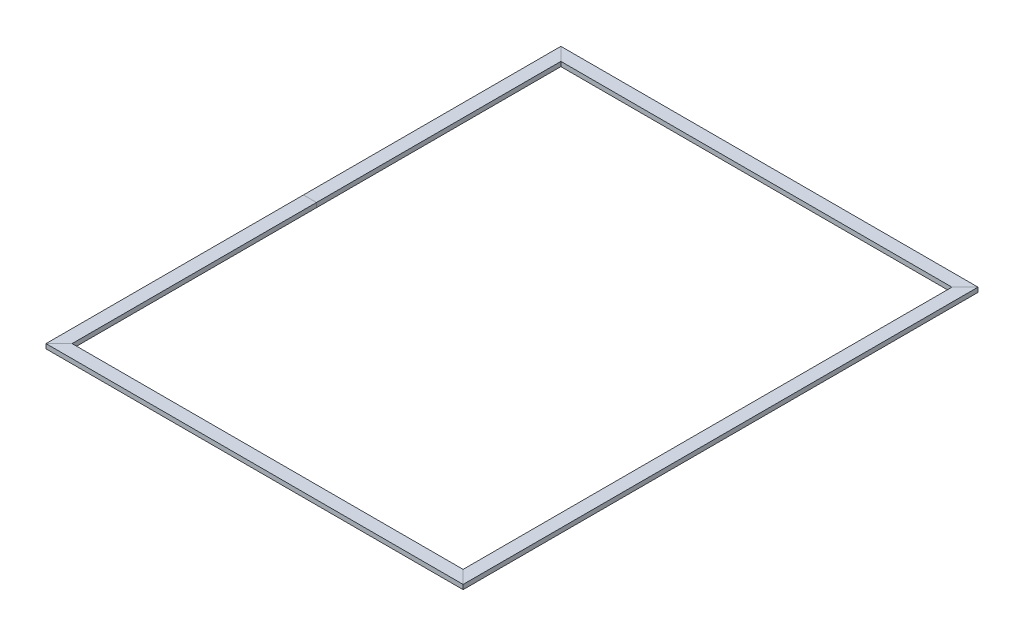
ISO-10303-21;
HEADER;
FILE_DESCRIPTION(('STEP AP214'),'2;1');
FILE_NAME('part.step','',(''),(''),'','','');
FILE_SCHEMA(('AUTOMOTIVE_DESIGN { 1 0 10303 214 1 1 1 1 }'));
ENDSEC;
DATA;
#1=APPLICATION_CONTEXT('core data for automotive mechanical design processes');
#2=APPLICATION_PROTOCOL_DEFINITION('international standard','automotive_design',2000,#1);
#3=PRODUCT_CONTEXT('',#1,'mechanical');
#4=PRODUCT('Part','Part','',(#3));
#5=PRODUCT_RELATED_PRODUCT_CATEGORY('part','',(#4));
#6=PRODUCT_DEFINITION_FORMATION('','',#4);
#7=PRODUCT_DEFINITION_CONTEXT('part definition',#1,'design');
#8=PRODUCT_DEFINITION('design','',#6,#7);
#9=PRODUCT_DEFINITION_SHAPE('','',#8);
#10=(LENGTH_UNIT() NAMED_UNIT(*) SI_UNIT(.MILLI.,.METRE.));
#11=(NAMED_UNIT(*) PLANE_ANGLE_UNIT() SI_UNIT($,.RADIAN.));
#12=(NAMED_UNIT(*) SI_UNIT($,.STERADIAN.) SOLID_ANGLE_UNIT());
#13=UNCERTAINTY_MEASURE_WITH_UNIT(LENGTH_MEASURE(1.E-05),#10,'distance_accuracy_value','');
#14=(GEOMETRIC_REPRESENTATION_CONTEXT(3) GLOBAL_UNCERTAINTY_ASSIGNED_CONTEXT((#13)) GLOBAL_UNIT_ASSIGNED_CONTEXT((#10,
#11,#12)) REPRESENTATION_CONTEXT('',''));
#15=CARTESIAN_POINT('',(0.,0.,0.));
#16=DIRECTION('',(0.,0.,1.));
#17=DIRECTION('',(1.,0.,0.));
#18=AXIS2_PLACEMENT_3D('',#15,#16,#17);
#19=CARTESIAN_POINT('',(642.1,7.00000000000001,790.));
#20=DIRECTION('',(0.,-1.,0.));
#21=DIRECTION('',(0.,0.,-1.));
#22=AXIS2_PLACEMENT_3D('',#19,#20,#21);
#23=PLANE('',#22);
#24=DIRECTION('',(-1.,0.,0.));
#25=VECTOR('',#24,1.);
#26=CARTESIAN_POINT('',(642.1,7.00000000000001,790.));
#27=LINE('',#26,#25);
#28=CARTESIAN_POINT('',(640.,7.00000000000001,790.));
#29=VERTEX_POINT('',#28);
#30=CARTESIAN_POINT('',(-640.,7.00000000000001,790.));
#31=VERTEX_POINT('',#30);
#32=EDGE_CURVE('E36',#29,#31,#27,.T.);
#33=ORIENTED_EDGE('',*,*,#32,.F.);
#34=DIRECTION('',(-0.707106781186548,0.,-0.707106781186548));
#35=VECTOR('',#34,1.);
#36=CARTESIAN_POINT('',(-151.05,7.00000000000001,-1.04999999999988));
#37=LINE('',#36,#35);
#38=CARTESIAN_POINT('',(600.,7.00000000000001,750.));
#39=VERTEX_POINT('',#38);
#40=EDGE_CURVE('E176',#29,#39,#37,.T.);
#41=ORIENTED_EDGE('',*,*,#40,.T.);
#42=DIRECTION('',(-1.,0.,0.));
#43=VECTOR('',#42,1.);
#44=CARTESIAN_POINT('',(642.1,7.00000000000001,750.));
#45=LINE('',#44,#43);
#46=CARTESIAN_POINT('',(-600.,7.00000000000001,750.));
#47=VERTEX_POINT('',#46);
#48=EDGE_CURVE('E162',#39,#47,#45,.T.);
#49=ORIENTED_EDGE('',*,*,#48,.T.);
#50=DIRECTION('',(0.707106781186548,0.,-0.707106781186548));
#51=VECTOR('',#50,1.);
#52=CARTESIAN_POINT('',(-641.05,7.00000000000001,791.05));
#53=LINE('',#52,#51);
#54=EDGE_CURVE('E92',#31,#47,#53,.T.);
#55=ORIENTED_EDGE('',*,*,#54,.F.);
#56=EDGE_LOOP('',(#33,#41,#49,#55));
#57=FACE_BOUND('',#56,.T.);
#58=ADVANCED_FACE('F33',(#57),#23,.F.);
#59=CARTESIAN_POINT('',(642.1,7.00000000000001,750.));
#60=DIRECTION('',(0.,0.,1.));
#61=DIRECTION('',(0.,-1.,0.));
#62=AXIS2_PLACEMENT_3D('',#59,#60,#61);
#63=PLANE('',#62);
#64=ORIENTED_EDGE('',*,*,#48,.F.);
#65=DIRECTION('',(0.,-1.,0.));
#66=VECTOR('',#65,1.);
#67=CARTESIAN_POINT('',(600.,7.00000000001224,750.));
#68=LINE('',#67,#66);
#69=CARTESIAN_POINT('',(600.,-6.99999999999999,750.));
#70=VERTEX_POINT('',#69);
#71=EDGE_CURVE('E171',#39,#70,#68,.T.);
#72=ORIENTED_EDGE('',*,*,#71,.T.);
#73=DIRECTION('',(-1.,0.,0.));
#74=VECTOR('',#73,1.);
#75=CARTESIAN_POINT('',(642.1,-6.99999999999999,750.));
#76=LINE('',#75,#74);
#77=CARTESIAN_POINT('',(-600.,-6.99999999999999,750.));
#78=VERTEX_POINT('',#77);
#79=EDGE_CURVE('E120',#70,#78,#76,.T.);
#80=ORIENTED_EDGE('',*,*,#79,.T.);
#81=DIRECTION('',(0.,-1.,0.));
#82=VECTOR('',#81,1.);
#83=CARTESIAN_POINT('',(-600.,6.99999999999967,750.));
#84=LINE('',#83,#82);
#85=EDGE_CURVE('E108',#47,#78,#84,.T.);
#86=ORIENTED_EDGE('',*,*,#85,.F.);
#87=EDGE_LOOP('',(#64,#72,#80,#86));
#88=FACE_BOUND('',#87,.T.);
#89=ADVANCED_FACE('F169',(#88),#63,.F.);
#90=CARTESIAN_POINT('',(642.1,-6.99999999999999,790.));
#91=DIRECTION('',(0.,1.,0.));
#92=DIRECTION('',(0.,0.,1.));
#93=AXIS2_PLACEMENT_3D('',#90,#91,#92);
#94=PLANE('',#93);
#95=ORIENTED_EDGE('',*,*,#79,.F.);
#96=DIRECTION('',(0.707106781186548,0.,0.707106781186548));
#97=VECTOR('',#96,1.);
#98=CARTESIAN_POINT('',(-151.05,-6.99999999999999,-1.05000000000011));
#99=LINE('',#98,#97);
#100=CARTESIAN_POINT('',(640.,-6.99999999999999,790.));
#101=VERTEX_POINT('',#100);
#102=EDGE_CURVE('E116',#70,#101,#99,.T.);
#103=ORIENTED_EDGE('',*,*,#102,.T.);
#104=DIRECTION('',(-1.,0.,0.));
#105=VECTOR('',#104,1.);
#106=CARTESIAN_POINT('',(642.1,-6.99999999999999,790.));
#107=LINE('',#106,#105);
#108=CARTESIAN_POINT('',(-640.,-6.99999999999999,790.));
#109=VERTEX_POINT('',#108);
#110=EDGE_CURVE('E113',#101,#109,#107,.T.);
#111=ORIENTED_EDGE('',*,*,#110,.T.);
#112=DIRECTION('',(-0.707106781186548,0.,0.707106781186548));
#113=VECTOR('',#112,1.);
#114=CARTESIAN_POINT('',(-641.05,-6.99999999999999,791.05));
#115=LINE('',#114,#113);
#116=EDGE_CURVE('E98',#78,#109,#115,.T.);
#117=ORIENTED_EDGE('',*,*,#116,.F.);
#118=EDGE_LOOP('',(#95,#103,#111,#117));
#119=FACE_BOUND('',#118,.T.);
#120=ADVANCED_FACE('F115',(#119),#94,.F.);
#121=CARTESIAN_POINT('',(642.1,7.00000000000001,790.));
#122=DIRECTION('',(0.,0.,-1.));
#123=DIRECTION('',(0.,1.,0.));
#124=AXIS2_PLACEMENT_3D('',#121,#122,#123);
#125=PLANE('',#124);
#126=ORIENTED_EDGE('',*,*,#110,.F.);
#127=DIRECTION('',(0.,1.,0.));
#128=VECTOR('',#127,1.);
#129=CARTESIAN_POINT('',(640.,6.99999999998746,790.));
#130=LINE('',#129,#128);
#131=EDGE_CURVE('E197',#101,#29,#130,.T.);
#132=ORIENTED_EDGE('',*,*,#131,.T.);
#133=ORIENTED_EDGE('',*,*,#32,.T.);
#134=DIRECTION('',(0.,1.,0.));
#135=VECTOR('',#134,1.);
#136=CARTESIAN_POINT('',(-640.,7.00000000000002,790.));
#137=LINE('',#136,#135);
#138=EDGE_CURVE('E122',#109,#31,#137,.T.);
#139=ORIENTED_EDGE('',*,*,#138,.F.);
#140=EDGE_LOOP('',(#126,#132,#133,#139));
#141=FACE_BOUND('',#140,.T.);
#142=ADVANCED_FACE('F123',(#141),#125,.F.);
#143=CARTESIAN_POINT('',(-640.,7.00000000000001,792.1));
#144=DIRECTION('',(1.,0.,0.));
#145=DIRECTION('',(0.,1.,0.));
#146=AXIS2_PLACEMENT_3D('',#143,#144,#145);
#147=PLANE('',#146);
#148=ORIENTED_EDGE('',*,*,#138,.T.);
#149=DIRECTION('',(0.,0.,-1.));
#150=VECTOR('',#149,1.);
#151=CARTESIAN_POINT('',(-640.,7.00000000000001,792.1));
#152=LINE('',#151,#150);
#153=CARTESIAN_POINT('',(-640.,7.00000000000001,0.));
#154=VERTEX_POINT('',#153);
#155=EDGE_CURVE('E132',#31,#154,#152,.T.);
#156=ORIENTED_EDGE('',*,*,#155,.T.);
#157=DIRECTION('',(0.,-1.,0.));
#158=VECTOR('',#157,1.);
#159=CARTESIAN_POINT('',(-640.,7.00000000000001,0.));
#160=LINE('',#159,#158);
#161=CARTESIAN_POINT('',(-640.,-6.99999999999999,0.));
#162=VERTEX_POINT('',#161);
#163=EDGE_CURVE('E131',#154,#162,#160,.T.);
#164=ORIENTED_EDGE('',*,*,#163,.T.);
#165=DIRECTION('',(0.,0.,-1.));
#166=VECTOR('',#165,1.);
#167=CARTESIAN_POINT('',(-640.,-6.99999999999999,792.1));
#168=LINE('',#167,#166);
#169=EDGE_CURVE('E103',#109,#162,#168,.T.);
#170=ORIENTED_EDGE('',*,*,#169,.F.);
#171=EDGE_LOOP('',(#148,#156,#164,#170));
#172=FACE_BOUND('',#171,.T.);
#173=ADVANCED_FACE('F129',(#172),#147,.F.);
#174=CARTESIAN_POINT('',(-640.,-6.99999999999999,792.1));
#175=DIRECTION('',(0.,1.,0.));
#176=DIRECTION('',(0.,0.,1.));
#177=AXIS2_PLACEMENT_3D('',#174,#175,#176);
#178=PLANE('',#177);
#179=ORIENTED_EDGE('',*,*,#116,.T.);
#180=ORIENTED_EDGE('',*,*,#169,.T.);
#181=DIRECTION('',(1.,0.,0.));
#182=VECTOR('',#181,1.);
#183=CARTESIAN_POINT('',(-640.,-6.99999999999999,0.));
#184=LINE('',#183,#182);
#185=CARTESIAN_POINT('',(-600.,-6.99999999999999,0.));
#186=VERTEX_POINT('',#185);
#187=EDGE_CURVE('E143',#162,#186,#184,.T.);
#188=ORIENTED_EDGE('',*,*,#187,.T.);
#189=DIRECTION('',(0.,0.,-1.));
#190=VECTOR('',#189,1.);
#191=CARTESIAN_POINT('',(-600.,-6.99999999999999,792.1));
#192=LINE('',#191,#190);
#193=EDGE_CURVE('E105',#78,#186,#192,.T.);
#194=ORIENTED_EDGE('',*,*,#193,.F.);
#195=EDGE_LOOP('',(#179,#180,#188,#194));
#196=FACE_BOUND('',#195,.T.);
#197=ADVANCED_FACE('F100',(#196),#178,.F.);
#198=CARTESIAN_POINT('',(-600.,7.00000000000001,792.1));
#199=DIRECTION('',(-1.,0.,0.));
#200=DIRECTION('',(0.,-1.,0.));
#201=AXIS2_PLACEMENT_3D('',#198,#199,#200);
#202=PLANE('',#201);
#203=ORIENTED_EDGE('',*,*,#85,.T.);
#204=ORIENTED_EDGE('',*,*,#193,.T.);
#205=DIRECTION('',(0.,1.,0.));
#206=VECTOR('',#205,1.);
#207=CARTESIAN_POINT('',(-600.,7.00000000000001,0.));
#208=LINE('',#207,#206);
#209=CARTESIAN_POINT('',(-600.,7.00000000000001,0.));
#210=VERTEX_POINT('',#209);
#211=EDGE_CURVE('E145',#186,#210,#208,.T.);
#212=ORIENTED_EDGE('',*,*,#211,.T.);
#213=DIRECTION('',(0.,0.,-1.));
#214=VECTOR('',#213,1.);
#215=CARTESIAN_POINT('',(-600.,7.00000000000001,792.1));
#216=LINE('',#215,#214);
#217=EDGE_CURVE('E134',#47,#210,#216,.T.);
#218=ORIENTED_EDGE('',*,*,#217,.F.);
#219=EDGE_LOOP('',(#203,#204,#212,#218));
#220=FACE_BOUND('',#219,.T.);
#221=ADVANCED_FACE('F268',(#220),#202,.F.);
#222=CARTESIAN_POINT('',(-640.,7.00000000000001,792.1));
#223=DIRECTION('',(0.,-1.,0.));
#224=DIRECTION('',(0.,0.,-1.));
#225=AXIS2_PLACEMENT_3D('',#222,#223,#224);
#226=PLANE('',#225);
#227=ORIENTED_EDGE('',*,*,#54,.T.);
#228=ORIENTED_EDGE('',*,*,#217,.T.);
#229=DIRECTION('',(-1.,0.,0.));
#230=VECTOR('',#229,1.);
#231=CARTESIAN_POINT('',(-640.,7.00000000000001,0.));
#232=LINE('',#231,#230);
#233=EDGE_CURVE('E148',#210,#154,#232,.T.);
#234=ORIENTED_EDGE('',*,*,#233,.T.);
#235=ORIENTED_EDGE('',*,*,#155,.F.);
#236=EDGE_LOOP('',(#227,#228,#234,#235));
#237=FACE_BOUND('',#236,.T.);
#238=ADVANCED_FACE('F250',(#237),#226,.F.);
#239=CARTESIAN_POINT('',(-640.,7.00000000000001,0.));
#240=DIRECTION('',(1.,0.,0.));
#241=DIRECTION('',(0.,1.,0.));
#242=AXIS2_PLACEMENT_3D('',#239,#240,#241);
#243=PLANE('',#242);
#244=DIRECTION('',(0.,0.,-1.));
#245=VECTOR('',#244,1.);
#246=CARTESIAN_POINT('',(-640.,-6.99999999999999,0.));
#247=LINE('',#246,#245);
#248=CARTESIAN_POINT('',(-640.,-6.99999999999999,-789.999999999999));
#249=VERTEX_POINT('',#248);
#250=EDGE_CURVE('E154',#162,#249,#247,.T.);
#251=ORIENTED_EDGE('',*,*,#250,.F.);
#252=ORIENTED_EDGE('',*,*,#163,.F.);
#253=DIRECTION('',(0.,0.,-1.));
#254=VECTOR('',#253,1.);
#255=CARTESIAN_POINT('',(-640.,7.00000000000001,0.));
#256=LINE('',#255,#254);
#257=CARTESIAN_POINT('',(-640.,7.00000000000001,-790.));
#258=VERTEX_POINT('',#257);
#259=EDGE_CURVE('E151',#154,#258,#256,.T.);
#260=ORIENTED_EDGE('',*,*,#259,.T.);
#261=DIRECTION('',(0.,1.,0.));
#262=VECTOR('',#261,1.);
#263=CARTESIAN_POINT('',(-640.,7.00000000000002,-789.999999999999));
#264=LINE('',#263,#262);
#265=EDGE_CURVE('E211',#249,#258,#264,.T.);
#266=ORIENTED_EDGE('',*,*,#265,.F.);
#267=EDGE_LOOP('',(#251,#252,#260,#266));
#268=FACE_BOUND('',#267,.T.);
#269=ADVANCED_FACE('F256',(#268),#243,.F.);
#270=CARTESIAN_POINT('',(-640.,-6.99999999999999,0.));
#271=DIRECTION('',(0.,1.,0.));
#272=DIRECTION('',(0.,0.,1.));
#273=AXIS2_PLACEMENT_3D('',#270,#271,#272);
#274=PLANE('',#273);
#275=DIRECTION('',(0.,0.,-1.));
#276=VECTOR('',#275,1.);
#277=CARTESIAN_POINT('',(-600.,-6.99999999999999,0.));
#278=LINE('',#277,#276);
#279=CARTESIAN_POINT('',(-600.,-6.99999999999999,-750.));
#280=VERTEX_POINT('',#279);
#281=EDGE_CURVE('E157',#186,#280,#278,.T.);
#282=ORIENTED_EDGE('',*,*,#281,.F.);
#283=ORIENTED_EDGE('',*,*,#187,.F.);
#284=ORIENTED_EDGE('',*,*,#250,.T.);
#285=DIRECTION('',(-0.707106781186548,0.,-0.707106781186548));
#286=VECTOR('',#285,1.);
#287=CARTESIAN_POINT('',(-641.05,-6.99999999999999,-791.049999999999));
#288=LINE('',#287,#286);
#289=EDGE_CURVE('E216',#280,#249,#288,.T.);
#290=ORIENTED_EDGE('',*,*,#289,.F.);
#291=EDGE_LOOP('',(#282,#283,#284,#290));
#292=FACE_BOUND('',#291,.T.);
#293=ADVANCED_FACE('F261',(#292),#274,.F.);
#294=CARTESIAN_POINT('',(-600.,7.00000000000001,0.));
#295=DIRECTION('',(-1.,0.,0.));
#296=DIRECTION('',(0.,-1.,0.));
#297=AXIS2_PLACEMENT_3D('',#294,#295,#296);
#298=PLANE('',#297);
#299=DIRECTION('',(0.,0.,-1.));
#300=VECTOR('',#299,1.);
#301=CARTESIAN_POINT('',(-600.,7.00000000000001,0.));
#302=LINE('',#301,#300);
#303=CARTESIAN_POINT('',(-600.,7.00000000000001,-750.));
#304=VERTEX_POINT('',#303);
#305=EDGE_CURVE('E109',#210,#304,#302,.T.);
#306=ORIENTED_EDGE('',*,*,#305,.F.);
#307=ORIENTED_EDGE('',*,*,#211,.F.);
#308=ORIENTED_EDGE('',*,*,#281,.T.);
#309=DIRECTION('',(0.,-1.,0.));
#310=VECTOR('',#309,1.);
#311=CARTESIAN_POINT('',(-600.,6.99999999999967,-749.999999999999));
#312=LINE('',#311,#310);
#313=EDGE_CURVE('E212',#304,#280,#312,.T.);
#314=ORIENTED_EDGE('',*,*,#313,.F.);
#315=EDGE_LOOP('',(#306,#307,#308,#314));
#316=FACE_BOUND('',#315,.T.);
#317=ADVANCED_FACE('F266',(#316),#298,.F.);
#318=CARTESIAN_POINT('',(-640.,7.00000000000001,0.));
#319=DIRECTION('',(0.,-1.,0.));
#320=DIRECTION('',(0.,0.,-1.));
#321=AXIS2_PLACEMENT_3D('',#318,#319,#320);
#322=PLANE('',#321);
#323=ORIENTED_EDGE('',*,*,#259,.F.);
#324=ORIENTED_EDGE('',*,*,#233,.F.);
#325=ORIENTED_EDGE('',*,*,#305,.T.);
#326=DIRECTION('',(0.707106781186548,0.,0.707106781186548));
#327=VECTOR('',#326,1.);
#328=CARTESIAN_POINT('',(-641.05,7.00000000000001,-791.049999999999));
#329=LINE('',#328,#327);
#330=EDGE_CURVE('E200',#258,#304,#329,.T.);
#331=ORIENTED_EDGE('',*,*,#330,.F.);
#332=EDGE_LOOP('',(#323,#324,#325,#331));
#333=FACE_BOUND('',#332,.T.);
#334=ADVANCED_FACE('F254',(#333),#322,.F.);
#335=CARTESIAN_POINT('',(640.,7.00000000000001,-792.1));
#336=DIRECTION('',(0.,-1.,0.));
#337=DIRECTION('',(0.,0.,-1.));
#338=AXIS2_PLACEMENT_3D('',#335,#336,#337);
#339=PLANE('',#338);
#340=DIRECTION('',(0.,0.,1.));
#341=VECTOR('',#340,1.);
#342=CARTESIAN_POINT('',(640.,7.00000000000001,-792.1));
#343=LINE('',#342,#341);
#344=CARTESIAN_POINT('',(639.999999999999,7.00000000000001,-790.));
#345=VERTEX_POINT('',#344);
#346=EDGE_CURVE('E190',#345,#29,#343,.T.);
#347=ORIENTED_EDGE('',*,*,#346,.F.);
#348=DIRECTION('',(-0.707106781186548,0.,0.707106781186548));
#349=VECTOR('',#348,1.);
#350=CARTESIAN_POINT('',(-1.05000000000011,7.00000000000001,-148.95));
#351=LINE('',#350,#349);
#352=CARTESIAN_POINT('',(599.999999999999,7.00000000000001,-750.));
#353=VERTEX_POINT('',#352);
#354=EDGE_CURVE('E223',#345,#353,#351,.T.);
#355=ORIENTED_EDGE('',*,*,#354,.T.);
#356=DIRECTION('',(0.,0.,1.));
#357=VECTOR('',#356,1.);
#358=CARTESIAN_POINT('',(600.,7.00000000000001,-792.1));
#359=LINE('',#358,#357);
#360=EDGE_CURVE('E126',#353,#39,#359,.T.);
#361=ORIENTED_EDGE('',*,*,#360,.T.);
#362=ORIENTED_EDGE('',*,*,#40,.F.);
#363=EDGE_LOOP('',(#347,#355,#361,#362));
#364=FACE_BOUND('',#363,.T.);
#365=ADVANCED_FACE('F249',(#364),#339,.F.);
#366=CARTESIAN_POINT('',(600.,7.00000000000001,-792.1));
#367=DIRECTION('',(1.,0.,0.));
#368=DIRECTION('',(0.,1.,0.));
#369=AXIS2_PLACEMENT_3D('',#366,#367,#368);
#370=PLANE('',#369);
#371=ORIENTED_EDGE('',*,*,#360,.F.);
#372=DIRECTION('',(0.,-1.,0.));
#373=VECTOR('',#372,1.);
#374=CARTESIAN_POINT('',(599.999999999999,7.00000000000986,-749.999999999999));
#375=LINE('',#374,#373);
#376=CARTESIAN_POINT('',(599.999999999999,-6.99999999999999,-750.));
#377=VERTEX_POINT('',#376);
#378=EDGE_CURVE('E184',#353,#377,#375,.T.);
#379=ORIENTED_EDGE('',*,*,#378,.T.);
#380=DIRECTION('',(0.,0.,1.));
#381=VECTOR('',#380,1.);
#382=CARTESIAN_POINT('',(600.,-6.99999999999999,-792.1));
#383=LINE('',#382,#381);
#384=EDGE_CURVE('E180',#377,#70,#383,.T.);
#385=ORIENTED_EDGE('',*,*,#384,.T.);
#386=ORIENTED_EDGE('',*,*,#71,.F.);
#387=EDGE_LOOP('',(#371,#379,#385,#386));
#388=FACE_BOUND('',#387,.T.);
#389=ADVANCED_FACE('F181',(#388),#370,.F.);
#390=CARTESIAN_POINT('',(639.999999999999,-6.99999999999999,-792.1));
#391=DIRECTION('',(0.,1.,0.));
#392=DIRECTION('',(0.,0.,1.));
#393=AXIS2_PLACEMENT_3D('',#390,#391,#392);
#394=PLANE('',#393);
#395=ORIENTED_EDGE('',*,*,#384,.F.);
#396=DIRECTION('',(0.707106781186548,0.,-0.707106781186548));
#397=VECTOR('',#396,1.);
#398=CARTESIAN_POINT('',(-1.05000000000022,-6.99999999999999,-148.95));
#399=LINE('',#398,#397);
#400=CARTESIAN_POINT('',(639.999999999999,-6.99999999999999,-789.999999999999));
#401=VERTEX_POINT('',#400);
#402=EDGE_CURVE('E215',#377,#401,#399,.T.);
#403=ORIENTED_EDGE('',*,*,#402,.T.);
#404=DIRECTION('',(0.,0.,1.));
#405=VECTOR('',#404,1.);
#406=CARTESIAN_POINT('',(639.999999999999,-6.99999999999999,-792.1));
#407=LINE('',#406,#405);
#408=EDGE_CURVE('E188',#401,#101,#407,.T.);
#409=ORIENTED_EDGE('',*,*,#408,.T.);
#410=ORIENTED_EDGE('',*,*,#102,.F.);
#411=EDGE_LOOP('',(#395,#403,#409,#410));
#412=FACE_BOUND('',#411,.T.);
#413=ADVANCED_FACE('F289',(#412),#394,.F.);
#414=CARTESIAN_POINT('',(640.,7.00000000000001,-792.1));
#415=DIRECTION('',(-1.,0.,0.));
#416=DIRECTION('',(0.,-1.,0.));
#417=AXIS2_PLACEMENT_3D('',#414,#415,#416);
#418=PLANE('',#417);
#419=ORIENTED_EDGE('',*,*,#408,.F.);
#420=DIRECTION('',(0.,1.,0.));
#421=VECTOR('',#420,1.);
#422=CARTESIAN_POINT('',(639.999999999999,6.99999999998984,-789.999999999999));
#423=LINE('',#422,#421);
#424=EDGE_CURVE('E50',#401,#345,#423,.T.);
#425=ORIENTED_EDGE('',*,*,#424,.T.);
#426=ORIENTED_EDGE('',*,*,#346,.T.);
#427=ORIENTED_EDGE('',*,*,#131,.F.);
#428=EDGE_LOOP('',(#419,#425,#426,#427));
#429=FACE_BOUND('',#428,.T.);
#430=ADVANCED_FACE('F227',(#429),#418,.F.);
#431=CARTESIAN_POINT('',(-642.1,7.00000000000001,-789.999999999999));
#432=DIRECTION('',(0.,-1.,0.));
#433=DIRECTION('',(0.,0.,-1.));
#434=AXIS2_PLACEMENT_3D('',#431,#432,#433);
#435=PLANE('',#434);
#436=ORIENTED_EDGE('',*,*,#330,.T.);
#437=DIRECTION('',(1.,0.,0.));
#438=VECTOR('',#437,1.);
#439=CARTESIAN_POINT('',(-642.1,7.00000000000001,-749.999999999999));
#440=LINE('',#439,#438);
#441=EDGE_CURVE('E206',#304,#353,#440,.T.);
#442=ORIENTED_EDGE('',*,*,#441,.T.);
#443=ORIENTED_EDGE('',*,*,#354,.F.);
#444=DIRECTION('',(1.,0.,0.));
#445=VECTOR('',#444,1.);
#446=CARTESIAN_POINT('',(-642.1,7.00000000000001,-789.999999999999));
#447=LINE('',#446,#445);
#448=EDGE_CURVE('E11',#258,#345,#447,.T.);
#449=ORIENTED_EDGE('',*,*,#448,.F.);
#450=EDGE_LOOP('',(#436,#442,#443,#449));
#451=FACE_BOUND('',#450,.T.);
#452=ADVANCED_FACE('F233',(#451),#435,.F.);
#453=CARTESIAN_POINT('',(-642.1,7.00000000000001,-749.999999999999));
#454=DIRECTION('',(0.,0.,-1.));
#455=DIRECTION('',(0.,1.,0.));
#456=AXIS2_PLACEMENT_3D('',#453,#454,#455);
#457=PLANE('',#456);
#458=ORIENTED_EDGE('',*,*,#313,.T.);
#459=DIRECTION('',(1.,0.,0.));
#460=VECTOR('',#459,1.);
#461=CARTESIAN_POINT('',(-642.1,-6.99999999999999,-750.));
#462=LINE('',#461,#460);
#463=EDGE_CURVE('E204',#280,#377,#462,.T.);
#464=ORIENTED_EDGE('',*,*,#463,.T.);
#465=ORIENTED_EDGE('',*,*,#378,.F.);
#466=ORIENTED_EDGE('',*,*,#441,.F.);
#467=EDGE_LOOP('',(#458,#464,#465,#466));
#468=FACE_BOUND('',#467,.T.);
#469=ADVANCED_FACE('F246',(#468),#457,.F.);
#470=CARTESIAN_POINT('',(-642.1,-6.99999999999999,-789.999999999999));
#471=DIRECTION('',(0.,1.,0.));
#472=DIRECTION('',(0.,0.,1.));
#473=AXIS2_PLACEMENT_3D('',#470,#471,#472);
#474=PLANE('',#473);
#475=ORIENTED_EDGE('',*,*,#289,.T.);
#476=DIRECTION('',(1.,0.,0.));
#477=VECTOR('',#476,1.);
#478=CARTESIAN_POINT('',(-642.1,-6.99999999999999,-789.999999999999));
#479=LINE('',#478,#477);
#480=EDGE_CURVE('E42',#249,#401,#479,.T.);
#481=ORIENTED_EDGE('',*,*,#480,.T.);
#482=ORIENTED_EDGE('',*,*,#402,.F.);
#483=ORIENTED_EDGE('',*,*,#463,.F.);
#484=EDGE_LOOP('',(#475,#481,#482,#483));
#485=FACE_BOUND('',#484,.T.);
#486=ADVANCED_FACE('F278',(#485),#474,.F.);
#487=CARTESIAN_POINT('',(-642.1,7.00000000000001,-789.999999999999));
#488=DIRECTION('',(0.,0.,1.));
#489=DIRECTION('',(0.,-1.,0.));
#490=AXIS2_PLACEMENT_3D('',#487,#488,#489);
#491=PLANE('',#490);
#492=ORIENTED_EDGE('',*,*,#265,.T.);
#493=ORIENTED_EDGE('',*,*,#448,.T.);
#494=ORIENTED_EDGE('',*,*,#424,.F.);
#495=ORIENTED_EDGE('',*,*,#480,.F.);
#496=EDGE_LOOP('',(#492,#493,#494,#495));
#497=FACE_BOUND('',#496,.T.);
#498=ADVANCED_FACE('F230',(#497),#491,.F.);
#499=CLOSED_SHELL('',(#58,#89,#120,#142,#173,#197,#221,#238,#269,#293,#317,#334,#365,#389,#413,
#430,#452,#469,#486,#498));
#500=MANIFOLD_SOLID_BREP('B2',#499);
#501=ADVANCED_BREP_SHAPE_REPRESENTATION('',(#18,#500),#14);
#502=SHAPE_DEFINITION_REPRESENTATION(#9,#501);
ENDSEC;
END-ISO-10303-21;
